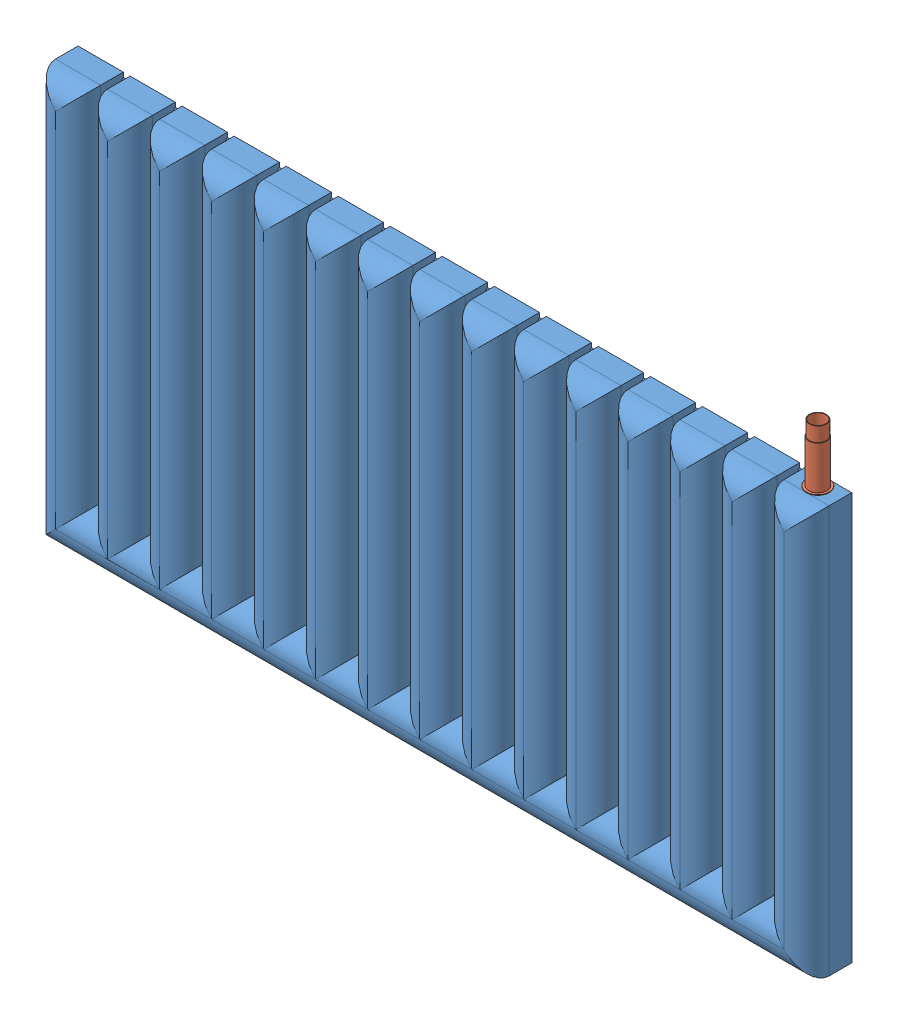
SolidWorks assembly FinalAssem1_A4.SLDASM, configuration Default (file format 3800). Lengths in mm.
Overall size (342 205.65 21.89).
3 component instances, 3 part files, 4 mates.
Components (placement in the parent):
- pressure_vesselv2_A4-1: pressure_vesselv2_A4.SLDPRT [Default] at (-126.6785 -21.9566 81.7635) size (342 180 20)
- stemv2_A4-1: stemv2_A4.SLDPRT [Default] at (205.3215 158.0434 86.7635) x (-0.849534 0 -0.527534) z (0.527534 0 -0.849534) size (10 25.65 10)
- filter_mock_v2_A4-1: filter_mock_v2_A4.SLDPRT [Default] at (205.3215 158.0434 86.7635) x (1 0 0) z (0 -1 0) size (8 8 0.12)
Mates (geometry in assembly coordinates):
- Concentric1: concentric anti-aligned: circle of ?; circle of ?
- Coincident1: coincident anti-aligned: plane of ? through (205.3215 205.7945 86.7635) normal (0 -1 0); plane of ? through (205.3215 205.7945 86.7635) normal (0 1 0)
- Concentric2: concentric aligned: circle of pressure_vesselv2_A4-1; circle of ?
- Coincident2: coincident anti-aligned: plane of pressure_vesselv2_A4-1 through (-126.6785 158.0434 101.7635) normal (0 1 0); plane of ? through (205.3215 205.7945 86.7635) normal (0 -1 0)
